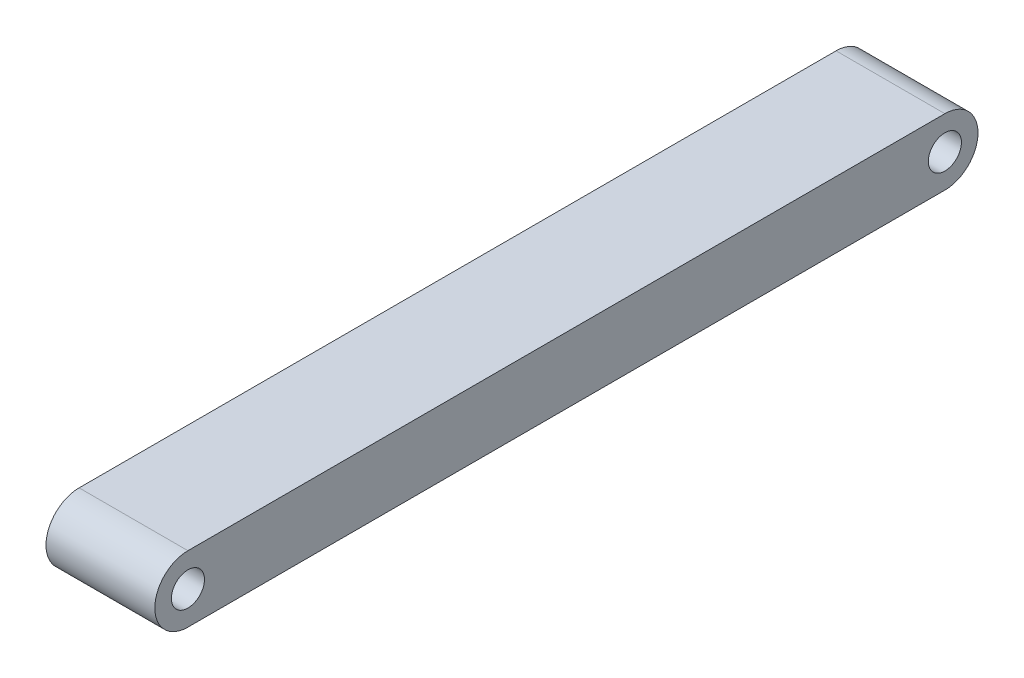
ISO-10303-21;
HEADER;
FILE_DESCRIPTION(('STEP AP214'),'2;1');
FILE_NAME('part.step','',(''),(''),'','','');
FILE_SCHEMA(('AUTOMOTIVE_DESIGN { 1 0 10303 214 1 1 1 1 }'));
ENDSEC;
DATA;
#1=APPLICATION_CONTEXT('core data for automotive mechanical design processes');
#2=APPLICATION_PROTOCOL_DEFINITION('international standard','automotive_design',2000,#1);
#3=PRODUCT_CONTEXT('',#1,'mechanical');
#4=PRODUCT('Part','Part','',(#3));
#5=PRODUCT_RELATED_PRODUCT_CATEGORY('part','',(#4));
#6=PRODUCT_DEFINITION_FORMATION('','',#4);
#7=PRODUCT_DEFINITION_CONTEXT('part definition',#1,'design');
#8=PRODUCT_DEFINITION('design','',#6,#7);
#9=PRODUCT_DEFINITION_SHAPE('','',#8);
#10=(LENGTH_UNIT() NAMED_UNIT(*) SI_UNIT(.MILLI.,.METRE.));
#11=(NAMED_UNIT(*) PLANE_ANGLE_UNIT() SI_UNIT($,.RADIAN.));
#12=(NAMED_UNIT(*) SI_UNIT($,.STERADIAN.) SOLID_ANGLE_UNIT());
#13=UNCERTAINTY_MEASURE_WITH_UNIT(LENGTH_MEASURE(1.E-05),#10,'distance_accuracy_value','');
#14=(GEOMETRIC_REPRESENTATION_CONTEXT(3) GLOBAL_UNCERTAINTY_ASSIGNED_CONTEXT((#13)) GLOBAL_UNIT_ASSIGNED_CONTEXT((#10,
#11,#12)) REPRESENTATION_CONTEXT('',''));
#15=CARTESIAN_POINT('',(0.,0.,0.));
#16=DIRECTION('',(0.,0.,1.));
#17=DIRECTION('',(1.,0.,0.));
#18=AXIS2_PLACEMENT_3D('',#15,#16,#17);
#19=CARTESIAN_POINT('',(115.,0.,0.));
#20=DIRECTION('',(1.,0.,0.));
#21=DIRECTION('',(0.,0.,-1.));
#22=AXIS2_PLACEMENT_3D('',#19,#20,#21);
#23=PLANE('',#22);
#24=CARTESIAN_POINT('',(115.,0.,0.));
#25=DIRECTION('',(1.,0.,0.));
#26=DIRECTION('',(0.,0.,-1.));
#27=AXIS2_PLACEMENT_3D('',#24,#25,#26);
#28=CIRCLE('',#27,17.5);
#29=CARTESIAN_POINT('',(115.,0.,-17.5));
#30=VERTEX_POINT('',#29);
#31=EDGE_CURVE('E112',#30,#30,#28,.T.);
#32=ORIENTED_EDGE('',*,*,#31,.F.);
#33=EDGE_LOOP('',(#32));
#34=FACE_BOUND('',#33,.T.);
#35=CARTESIAN_POINT('',(115.,0.,0.));
#36=DIRECTION('',(1.,0.,0.));
#37=DIRECTION('',(0.,0.,-1.));
#38=AXIS2_PLACEMENT_3D('',#35,#36,#37);
#39=CIRCLE('',#38,35.);
#40=CARTESIAN_POINT('',(115.,35.,0.));
#41=VERTEX_POINT('',#40);
#42=CARTESIAN_POINT('',(115.,-35.,0.));
#43=VERTEX_POINT('',#42);
#44=EDGE_CURVE('E92',#41,#43,#39,.T.);
#45=ORIENTED_EDGE('',*,*,#44,.T.);
#46=DIRECTION('',(0.,0.,-1.));
#47=VECTOR('',#46,1.);
#48=CARTESIAN_POINT('',(115.,-35.,0.));
#49=LINE('',#48,#47);
#50=CARTESIAN_POINT('',(115.,-35.,-800.));
#51=VERTEX_POINT('',#50);
#52=EDGE_CURVE('E87',#43,#51,#49,.T.);
#53=ORIENTED_EDGE('',*,*,#52,.T.);
#54=CARTESIAN_POINT('',(115.,0.,-800.));
#55=DIRECTION('',(1.,0.,0.));
#56=DIRECTION('',(0.,0.,-1.));
#57=AXIS2_PLACEMENT_3D('',#54,#55,#56);
#58=CIRCLE('',#57,35.);
#59=CARTESIAN_POINT('',(115.,35.,-800.));
#60=VERTEX_POINT('',#59);
#61=EDGE_CURVE('E90',#51,#60,#58,.T.);
#62=ORIENTED_EDGE('',*,*,#61,.T.);
#63=DIRECTION('',(0.,0.,1.));
#64=VECTOR('',#63,1.);
#65=CARTESIAN_POINT('',(115.,35.,0.));
#66=LINE('',#65,#64);
#67=EDGE_CURVE('E57',#60,#41,#66,.T.);
#68=ORIENTED_EDGE('',*,*,#67,.T.);
#69=EDGE_LOOP('',(#45,#53,#62,#68));
#70=FACE_BOUND('',#69,.T.);
#71=CARTESIAN_POINT('',(115.,0.,-800.));
#72=DIRECTION('',(1.,0.,0.));
#73=DIRECTION('',(0.,0.,-1.));
#74=AXIS2_PLACEMENT_3D('',#71,#72,#73);
#75=CIRCLE('',#74,17.4999999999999);
#76=CARTESIAN_POINT('',(115.,0.,-817.5));
#77=VERTEX_POINT('',#76);
#78=EDGE_CURVE('E134',#77,#77,#75,.T.);
#79=ORIENTED_EDGE('',*,*,#78,.F.);
#80=EDGE_LOOP('',(#79));
#81=FACE_BOUND('',#80,.T.);
#82=ADVANCED_FACE('F39',(#34,#70,#81),#23,.T.);
#83=CARTESIAN_POINT('',(0.,0.,0.));
#84=DIRECTION('',(1.,0.,0.));
#85=DIRECTION('',(0.,0.,-1.));
#86=AXIS2_PLACEMENT_3D('',#83,#84,#85);
#87=PLANE('',#86);
#88=CARTESIAN_POINT('',(0.,0.,0.));
#89=DIRECTION('',(1.,0.,0.));
#90=DIRECTION('',(0.,0.,-1.));
#91=AXIS2_PLACEMENT_3D('',#88,#89,#90);
#92=CIRCLE('',#91,35.);
#93=CARTESIAN_POINT('',(0.,35.,0.));
#94=VERTEX_POINT('',#93);
#95=CARTESIAN_POINT('',(0.,-35.,0.));
#96=VERTEX_POINT('',#95);
#97=EDGE_CURVE('E108',#94,#96,#92,.T.);
#98=ORIENTED_EDGE('',*,*,#97,.F.);
#99=DIRECTION('',(0.,0.,1.));
#100=VECTOR('',#99,1.);
#101=CARTESIAN_POINT('',(0.,35.,0.));
#102=LINE('',#101,#100);
#103=CARTESIAN_POINT('',(0.,35.,-800.));
#104=VERTEX_POINT('',#103);
#105=EDGE_CURVE('E80',#104,#94,#102,.T.);
#106=ORIENTED_EDGE('',*,*,#105,.F.);
#107=CARTESIAN_POINT('',(0.,0.,-800.));
#108=DIRECTION('',(1.,0.,0.));
#109=DIRECTION('',(0.,0.,-1.));
#110=AXIS2_PLACEMENT_3D('',#107,#108,#109);
#111=CIRCLE('',#110,35.);
#112=CARTESIAN_POINT('',(0.,-35.,-800.));
#113=VERTEX_POINT('',#112);
#114=EDGE_CURVE('E74',#113,#104,#111,.T.);
#115=ORIENTED_EDGE('',*,*,#114,.F.);
#116=DIRECTION('',(0.,0.,-1.));
#117=VECTOR('',#116,1.);
#118=CARTESIAN_POINT('',(0.,-35.,0.));
#119=LINE('',#118,#117);
#120=EDGE_CURVE('E97',#96,#113,#119,.T.);
#121=ORIENTED_EDGE('',*,*,#120,.F.);
#122=EDGE_LOOP('',(#98,#106,#115,#121));
#123=FACE_BOUND('',#122,.T.);
#124=CARTESIAN_POINT('',(0.,0.,0.));
#125=DIRECTION('',(1.,0.,0.));
#126=DIRECTION('',(0.,0.,-1.));
#127=AXIS2_PLACEMENT_3D('',#124,#125,#126);
#128=CIRCLE('',#127,17.5);
#129=CARTESIAN_POINT('',(0.,0.,-17.5));
#130=VERTEX_POINT('',#129);
#131=EDGE_CURVE('E130',#130,#130,#128,.T.);
#132=ORIENTED_EDGE('',*,*,#131,.T.);
#133=EDGE_LOOP('',(#132));
#134=FACE_BOUND('',#133,.T.);
#135=CARTESIAN_POINT('',(0.,0.,-800.));
#136=DIRECTION('',(1.,0.,0.));
#137=DIRECTION('',(0.,0.,-1.));
#138=AXIS2_PLACEMENT_3D('',#135,#136,#137);
#139=CIRCLE('',#138,17.4999999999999);
#140=CARTESIAN_POINT('',(0.,0.,-817.5));
#141=VERTEX_POINT('',#140);
#142=EDGE_CURVE('E138',#141,#141,#139,.T.);
#143=ORIENTED_EDGE('',*,*,#142,.T.);
#144=EDGE_LOOP('',(#143));
#145=FACE_BOUND('',#144,.T.);
#146=ADVANCED_FACE('F125',(#123,#134,#145),#87,.F.);
#147=CARTESIAN_POINT('',(115.,0.,0.));
#148=DIRECTION('',(-1.,0.,0.));
#149=DIRECTION('',(0.,0.,1.));
#150=AXIS2_PLACEMENT_3D('',#147,#148,#149);
#151=CYLINDRICAL_SURFACE('',#150,35.);
#152=ORIENTED_EDGE('',*,*,#97,.T.);
#153=DIRECTION('',(-1.,0.,0.));
#154=VECTOR('',#153,1.);
#155=CARTESIAN_POINT('',(115.,-35.,0.));
#156=LINE('',#155,#154);
#157=EDGE_CURVE('E11',#43,#96,#156,.T.);
#158=ORIENTED_EDGE('',*,*,#157,.F.);
#159=ORIENTED_EDGE('',*,*,#44,.F.);
#160=DIRECTION('',(-1.,0.,0.));
#161=VECTOR('',#160,1.);
#162=CARTESIAN_POINT('',(115.,35.,0.));
#163=LINE('',#162,#161);
#164=EDGE_CURVE('E104',#41,#94,#163,.T.);
#165=ORIENTED_EDGE('',*,*,#164,.T.);
#166=EDGE_LOOP('',(#152,#158,#159,#165));
#167=FACE_BOUND('',#166,.T.);
#168=ADVANCED_FACE('F41',(#167),#151,.T.);
#169=CARTESIAN_POINT('',(115.,-35.,0.));
#170=DIRECTION('',(0.,1.,0.));
#171=DIRECTION('',(0.,0.,1.));
#172=AXIS2_PLACEMENT_3D('',#169,#170,#171);
#173=PLANE('',#172);
#174=ORIENTED_EDGE('',*,*,#120,.T.);
#175=DIRECTION('',(-1.,0.,0.));
#176=VECTOR('',#175,1.);
#177=CARTESIAN_POINT('',(115.,-35.,-800.));
#178=LINE('',#177,#176);
#179=EDGE_CURVE('E49',#51,#113,#178,.T.);
#180=ORIENTED_EDGE('',*,*,#179,.F.);
#181=ORIENTED_EDGE('',*,*,#52,.F.);
#182=ORIENTED_EDGE('',*,*,#157,.T.);
#183=EDGE_LOOP('',(#174,#180,#181,#182));
#184=FACE_BOUND('',#183,.T.);
#185=ADVANCED_FACE('F96',(#184),#173,.F.);
#186=CARTESIAN_POINT('',(115.,0.,-800.));
#187=DIRECTION('',(-1.,0.,0.));
#188=DIRECTION('',(0.,0.,1.));
#189=AXIS2_PLACEMENT_3D('',#186,#187,#188);
#190=CYLINDRICAL_SURFACE('',#189,35.);
#191=ORIENTED_EDGE('',*,*,#114,.T.);
#192=DIRECTION('',(-1.,0.,0.));
#193=VECTOR('',#192,1.);
#194=CARTESIAN_POINT('',(115.,35.,-800.));
#195=LINE('',#194,#193);
#196=EDGE_CURVE('E99',#60,#104,#195,.T.);
#197=ORIENTED_EDGE('',*,*,#196,.F.);
#198=ORIENTED_EDGE('',*,*,#61,.F.);
#199=ORIENTED_EDGE('',*,*,#179,.T.);
#200=EDGE_LOOP('',(#191,#197,#198,#199));
#201=FACE_BOUND('',#200,.T.);
#202=ADVANCED_FACE('F100',(#201),#190,.T.);
#203=CARTESIAN_POINT('',(115.,35.,0.));
#204=DIRECTION('',(0.,-1.,0.));
#205=DIRECTION('',(0.,0.,-1.));
#206=AXIS2_PLACEMENT_3D('',#203,#204,#205);
#207=PLANE('',#206);
#208=ORIENTED_EDGE('',*,*,#105,.T.);
#209=ORIENTED_EDGE('',*,*,#164,.F.);
#210=ORIENTED_EDGE('',*,*,#67,.F.);
#211=ORIENTED_EDGE('',*,*,#196,.T.);
#212=EDGE_LOOP('',(#208,#209,#210,#211));
#213=FACE_BOUND('',#212,.T.);
#214=ADVANCED_FACE('F122',(#213),#207,.F.);
#215=CARTESIAN_POINT('',(115.,0.,0.));
#216=DIRECTION('',(-1.,0.,0.));
#217=DIRECTION('',(0.,0.,1.));
#218=AXIS2_PLACEMENT_3D('',#215,#216,#217);
#219=CYLINDRICAL_SURFACE('',#218,17.5);
#220=ORIENTED_EDGE('',*,*,#31,.T.);
#221=EDGE_LOOP('',(#220));
#222=FACE_BOUND('',#221,.T.);
#223=ORIENTED_EDGE('',*,*,#131,.F.);
#224=EDGE_LOOP('',(#223));
#225=FACE_BOUND('',#224,.T.);
#226=ADVANCED_FACE('F157',(#222,#225),#219,.F.);
#227=CARTESIAN_POINT('',(115.,0.,-800.));
#228=DIRECTION('',(-1.,0.,0.));
#229=DIRECTION('',(0.,0.,1.));
#230=AXIS2_PLACEMENT_3D('',#227,#228,#229);
#231=CYLINDRICAL_SURFACE('',#230,17.4999999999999);
#232=ORIENTED_EDGE('',*,*,#78,.T.);
#233=EDGE_LOOP('',(#232));
#234=FACE_BOUND('',#233,.T.);
#235=ORIENTED_EDGE('',*,*,#142,.F.);
#236=EDGE_LOOP('',(#235));
#237=FACE_BOUND('',#236,.T.);
#238=ADVANCED_FACE('F146',(#234,#237),#231,.F.);
#239=CLOSED_SHELL('',(#82,#146,#168,#185,#202,#214,#226,#238));
#240=MANIFOLD_SOLID_BREP('B2',#239);
#241=ADVANCED_BREP_SHAPE_REPRESENTATION('',(#18,#240),#14);
#242=SHAPE_DEFINITION_REPRESENTATION(#9,#241);
ENDSEC;
END-ISO-10303-21;
